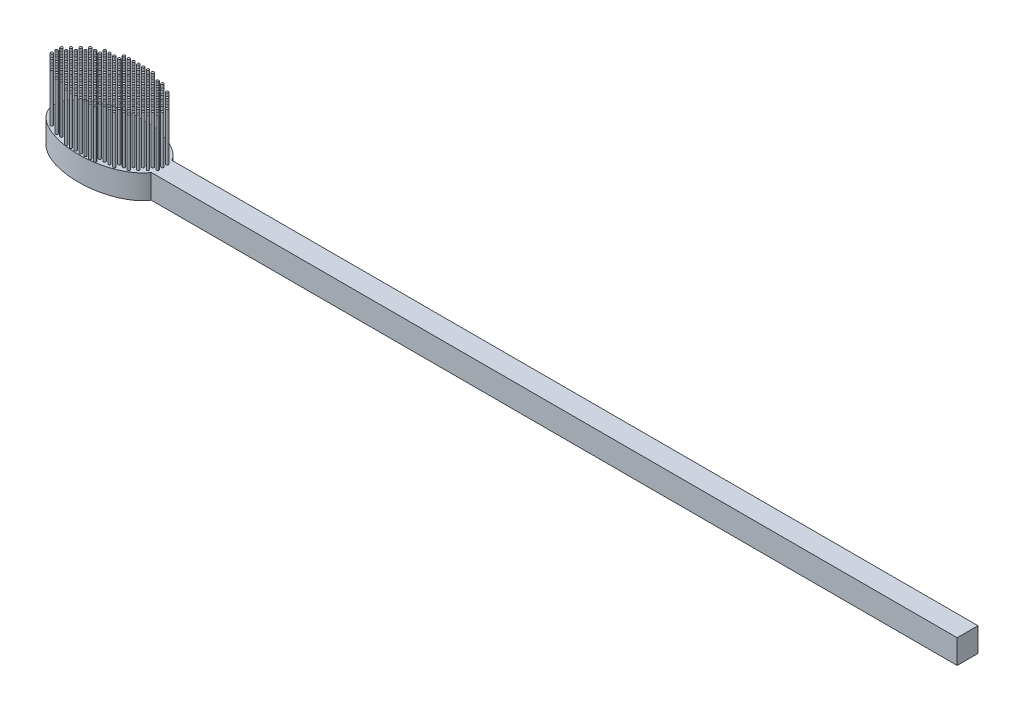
from build123d import *

# Parameters (mm, degrees)
BOSS_EXTRUDE1_DEPTH       = 5
SKETCH3_R                 = 0.25
BOSS_EXTRUDE2_DEPTH       = 10
LPATTERN1_COUNT           = 12
LPATTERN1_PITCH           = 1
LPATTERN1_COUNT_DIR2      = 7
LPATTERN1_PITCH_DIR2      = 1
MIRROR1_COPY_1_SKETCH_R   = 0.25
MIRROR1_COPY_1_DEPTH      = 10
MIRROR1_COPY_2_SKETCH_R   = 0.25
MIRROR1_COPY_2_DEPTH      = 10
MIRROR1_COPY_3_SKETCH_R   = 0.25
MIRROR1_COPY_3_DEPTH      = 10
MIRROR1_COPY_4_SKETCH_R   = 0.25
MIRROR1_COPY_4_DEPTH      = 10
MIRROR1_COPY_5_SKETCH_R   = 0.25
MIRROR1_COPY_5_DEPTH      = 10
MIRROR1_COPY_6_SKETCH_R   = 0.25
MIRROR1_COPY_6_DEPTH      = 10
MIRROR1_COPY_7_SKETCH_R   = 0.25
MIRROR1_COPY_7_DEPTH      = 10
MIRROR1_COPY_8_SKETCH_R   = 0.25
MIRROR1_COPY_8_DEPTH      = 10
MIRROR1_COPY_9_SKETCH_R   = 0.25
MIRROR1_COPY_9_DEPTH      = 10
MIRROR1_COPY_10_SKETCH_R  = 0.25
MIRROR1_COPY_10_DEPTH     = 10
MIRROR1_COPY_11_SKETCH_R  = 0.25
MIRROR1_COPY_11_DEPTH     = 10
MIRROR1_COPY_12_SKETCH_R  = 0.25
MIRROR1_COPY_12_DEPTH     = 10
MIRROR1_COPY_13_SKETCH_R  = 0.25
MIRROR1_COPY_13_DEPTH     = 10
MIRROR1_COPY_14_SKETCH_R  = 0.25
MIRROR1_COPY_14_DEPTH     = 10
MIRROR1_COPY_15_SKETCH_R  = 0.25
MIRROR1_COPY_15_DEPTH     = 10
MIRROR1_COPY_16_SKETCH_R  = 0.25
MIRROR1_COPY_16_DEPTH     = 10
MIRROR1_COPY_17_SKETCH_R  = 0.25
MIRROR1_COPY_17_DEPTH     = 10
MIRROR1_COPY_18_SKETCH_R  = 0.25
MIRROR1_COPY_18_DEPTH     = 10
MIRROR1_COPY_19_SKETCH_R  = 0.25
MIRROR1_COPY_19_DEPTH     = 10
MIRROR1_COPY_20_SKETCH_R  = 0.25
MIRROR1_COPY_20_DEPTH     = 10
MIRROR1_COPY_21_SKETCH_R  = 0.25
MIRROR1_COPY_21_DEPTH     = 10
MIRROR1_COPY_22_SKETCH_R  = 0.25
MIRROR1_COPY_22_DEPTH     = 10
MIRROR1_COPY_23_SKETCH_R  = 0.25
MIRROR1_COPY_23_DEPTH     = 10
MIRROR1_COPY_24_SKETCH_R  = 0.25
MIRROR1_COPY_24_DEPTH     = 10
MIRROR1_COPY_25_SKETCH_R  = 0.25
MIRROR1_COPY_25_DEPTH     = 10
MIRROR1_COPY_26_SKETCH_R  = 0.25
MIRROR1_COPY_26_DEPTH     = 10
MIRROR1_COPY_27_SKETCH_R  = 0.25
MIRROR1_COPY_27_DEPTH     = 10
MIRROR1_COPY_28_SKETCH_R  = 0.25
MIRROR1_COPY_28_DEPTH     = 10
MIRROR1_COPY_29_SKETCH_R  = 0.25
MIRROR1_COPY_29_DEPTH     = 10
MIRROR1_COPY_30_SKETCH_R  = 0.25
MIRROR1_COPY_30_DEPTH     = 10
MIRROR1_COPY_31_SKETCH_R  = 0.25
MIRROR1_COPY_31_DEPTH     = 10
MIRROR1_COPY_32_SKETCH_R  = 0.25
MIRROR1_COPY_32_DEPTH     = 10
MIRROR1_COPY_33_SKETCH_R  = 0.25
MIRROR1_COPY_33_DEPTH     = 10
MIRROR1_COPY_34_SKETCH_R  = 0.25
MIRROR1_COPY_34_DEPTH     = 10
MIRROR1_COPY_35_SKETCH_R  = 0.25
MIRROR1_COPY_35_DEPTH     = 10
MIRROR1_COPY_36_SKETCH_R  = 0.25
MIRROR1_COPY_36_DEPTH     = 10
MIRROR1_COPY_37_SKETCH_R  = 0.25
MIRROR1_COPY_37_DEPTH     = 10
MIRROR1_COPY_38_SKETCH_R  = 0.25
MIRROR1_COPY_38_DEPTH     = 10
MIRROR1_COPY_39_SKETCH_R  = 0.25
MIRROR1_COPY_39_DEPTH     = 10
MIRROR1_COPY_40_SKETCH_R  = 0.25
MIRROR1_COPY_40_DEPTH     = 10
MIRROR1_COPY_41_SKETCH_R  = 0.25
MIRROR1_COPY_41_DEPTH     = 10
MIRROR1_COPY_42_SKETCH_R  = 0.25
MIRROR1_COPY_42_DEPTH     = 10
MIRROR1_COPY_43_SKETCH_R  = 0.25
MIRROR1_COPY_43_DEPTH     = 10
MIRROR1_COPY_44_SKETCH_R  = 0.25
MIRROR1_COPY_44_DEPTH     = 10
MIRROR1_COPY_45_SKETCH_R  = 0.25
MIRROR1_COPY_45_DEPTH     = 10
MIRROR1_COPY_46_SKETCH_R  = 0.25
MIRROR1_COPY_46_DEPTH     = 10
MIRROR1_COPY_47_SKETCH_R  = 0.25
MIRROR1_COPY_47_DEPTH     = 10
MIRROR1_COPY_48_SKETCH_R  = 0.25
MIRROR1_COPY_48_DEPTH     = 10
MIRROR1_COPY_49_SKETCH_R  = 0.25
MIRROR1_COPY_49_DEPTH     = 10
MIRROR1_COPY_50_SKETCH_R  = 0.25
MIRROR1_COPY_50_DEPTH     = 10
MIRROR1_COPY_51_SKETCH_R  = 0.25
MIRROR1_COPY_51_DEPTH     = 10
MIRROR1_COPY_52_SKETCH_R  = 0.25
MIRROR1_COPY_52_DEPTH     = 10
MIRROR1_COPY_53_SKETCH_R  = 0.25
MIRROR1_COPY_53_DEPTH     = 10
MIRROR1_COPY_54_SKETCH_R  = 0.25
MIRROR1_COPY_54_DEPTH     = 10
MIRROR1_COPY_55_SKETCH_R  = 0.25
MIRROR1_COPY_55_DEPTH     = 10
MIRROR1_COPY_56_SKETCH_R  = 0.25
MIRROR1_COPY_56_DEPTH     = 10
MIRROR1_COPY_57_SKETCH_R  = 0.25
MIRROR1_COPY_57_DEPTH     = 10
MIRROR1_COPY_58_SKETCH_R  = 0.25
MIRROR1_COPY_58_DEPTH     = 10
MIRROR1_COPY_59_SKETCH_R  = 0.25
MIRROR1_COPY_59_DEPTH     = 10
MIRROR1_COPY_60_SKETCH_R  = 0.25
MIRROR1_COPY_60_DEPTH     = 10
MIRROR1_COPY_61_SKETCH_R  = 0.25
MIRROR1_COPY_61_DEPTH     = 10
MIRROR1_COPY_62_SKETCH_R  = 0.25
MIRROR1_COPY_62_DEPTH     = 10
MIRROR1_COPY_63_SKETCH_R  = 0.25
MIRROR1_COPY_63_DEPTH     = 10
MIRROR1_COPY_64_SKETCH_R  = 0.25
MIRROR1_COPY_64_DEPTH     = 10
MIRROR1_COPY_65_SKETCH_R  = 0.25
MIRROR1_COPY_65_DEPTH     = 10
MIRROR2_COPY_1_SKETCH_R   = 0.25
MIRROR2_COPY_1_DEPTH      = 10
MIRROR2_COPY_2_SKETCH_R   = 0.25
MIRROR2_COPY_2_DEPTH      = 10
MIRROR2_COPY_3_SKETCH_R   = 0.25
MIRROR2_COPY_3_DEPTH      = 10
MIRROR2_COPY_4_SKETCH_R   = 0.25
MIRROR2_COPY_4_DEPTH      = 10
MIRROR2_COPY_5_SKETCH_R   = 0.25
MIRROR2_COPY_5_DEPTH      = 10
MIRROR2_COPY_6_SKETCH_R   = 0.25
MIRROR2_COPY_6_DEPTH      = 10
MIRROR2_COPY_7_SKETCH_R   = 0.25
MIRROR2_COPY_7_DEPTH      = 10
MIRROR2_COPY_8_SKETCH_R   = 0.25
MIRROR2_COPY_8_DEPTH      = 10
MIRROR2_COPY_9_SKETCH_R   = 0.25
MIRROR2_COPY_9_DEPTH      = 10
MIRROR2_COPY_10_SKETCH_R  = 0.25
MIRROR2_COPY_10_DEPTH     = 10
MIRROR2_COPY_11_SKETCH_R  = 0.25
MIRROR2_COPY_11_DEPTH     = 10
MIRROR2_COPY_12_SKETCH_R  = 0.25
MIRROR2_COPY_12_DEPTH     = 10
MIRROR2_COPY_13_SKETCH_R  = 0.25
MIRROR2_COPY_13_DEPTH     = 10
MIRROR2_COPY_14_SKETCH_R  = 0.25
MIRROR2_COPY_14_DEPTH     = 10
MIRROR2_COPY_15_SKETCH_R  = 0.25
MIRROR2_COPY_15_DEPTH     = 10
MIRROR2_COPY_16_SKETCH_R  = 0.25
MIRROR2_COPY_16_DEPTH     = 10
MIRROR2_COPY_17_SKETCH_R  = 0.25
MIRROR2_COPY_17_DEPTH     = 10
MIRROR2_COPY_18_SKETCH_R  = 0.25
MIRROR2_COPY_18_DEPTH     = 10
MIRROR2_COPY_19_SKETCH_R  = 0.25
MIRROR2_COPY_19_DEPTH     = 10
MIRROR2_COPY_20_SKETCH_R  = 0.25
MIRROR2_COPY_20_DEPTH     = 10
MIRROR2_COPY_21_SKETCH_R  = 0.25
MIRROR2_COPY_21_DEPTH     = 10
MIRROR2_COPY_22_SKETCH_R  = 0.25
MIRROR2_COPY_22_DEPTH     = 10
MIRROR2_COPY_23_SKETCH_R  = 0.25
MIRROR2_COPY_23_DEPTH     = 10
MIRROR2_COPY_24_SKETCH_R  = 0.25
MIRROR2_COPY_24_DEPTH     = 10
MIRROR2_COPY_25_SKETCH_R  = 0.25
MIRROR2_COPY_25_DEPTH     = 10
MIRROR2_COPY_26_SKETCH_R  = 0.25
MIRROR2_COPY_26_DEPTH     = 10
MIRROR2_COPY_27_SKETCH_R  = 0.25
MIRROR2_COPY_27_DEPTH     = 10
MIRROR2_COPY_28_SKETCH_R  = 0.25
MIRROR2_COPY_28_DEPTH     = 10
MIRROR2_COPY_29_SKETCH_R  = 0.25
MIRROR2_COPY_29_DEPTH     = 10
MIRROR2_COPY_30_SKETCH_R  = 0.25
MIRROR2_COPY_30_DEPTH     = 10
MIRROR2_COPY_31_SKETCH_R  = 0.25
MIRROR2_COPY_31_DEPTH     = 10
MIRROR2_COPY_32_SKETCH_R  = 0.25
MIRROR2_COPY_32_DEPTH     = 10
MIRROR2_COPY_33_SKETCH_R  = 0.25
MIRROR2_COPY_33_DEPTH     = 10
MIRROR2_COPY_34_SKETCH_R  = 0.25
MIRROR2_COPY_34_DEPTH     = 10
MIRROR2_COPY_35_SKETCH_R  = 0.25
MIRROR2_COPY_35_DEPTH     = 10
MIRROR2_COPY_36_SKETCH_R  = 0.25
MIRROR2_COPY_36_DEPTH     = 10
MIRROR2_COPY_37_SKETCH_R  = 0.25
MIRROR2_COPY_37_DEPTH     = 10
MIRROR2_COPY_38_SKETCH_R  = 0.25
MIRROR2_COPY_38_DEPTH     = 10
MIRROR2_COPY_39_SKETCH_R  = 0.25
MIRROR2_COPY_39_DEPTH     = 10
MIRROR2_COPY_40_SKETCH_R  = 0.25
MIRROR2_COPY_40_DEPTH     = 10
MIRROR2_COPY_41_SKETCH_R  = 0.25
MIRROR2_COPY_41_DEPTH     = 10
MIRROR2_COPY_42_SKETCH_R  = 0.25
MIRROR2_COPY_42_DEPTH     = 10
MIRROR2_COPY_43_SKETCH_R  = 0.25
MIRROR2_COPY_43_DEPTH     = 10
MIRROR2_COPY_44_SKETCH_R  = 0.25
MIRROR2_COPY_44_DEPTH     = 10
MIRROR2_COPY_45_SKETCH_R  = 0.25
MIRROR2_COPY_45_DEPTH     = 10
MIRROR2_COPY_46_SKETCH_R  = 0.25
MIRROR2_COPY_46_DEPTH     = 10
MIRROR2_COPY_47_SKETCH_R  = 0.25
MIRROR2_COPY_47_DEPTH     = 10
MIRROR2_COPY_48_SKETCH_R  = 0.25
MIRROR2_COPY_48_DEPTH     = 10
MIRROR2_COPY_49_SKETCH_R  = 0.25
MIRROR2_COPY_49_DEPTH     = 10
MIRROR2_COPY_50_SKETCH_R  = 0.25
MIRROR2_COPY_50_DEPTH     = 10
MIRROR2_COPY_51_SKETCH_R  = 0.25
MIRROR2_COPY_51_DEPTH     = 10
MIRROR2_COPY_52_SKETCH_R  = 0.25
MIRROR2_COPY_52_DEPTH     = 10
MIRROR2_COPY_53_SKETCH_R  = 0.25
MIRROR2_COPY_53_DEPTH     = 10
MIRROR2_COPY_54_SKETCH_R  = 0.25
MIRROR2_COPY_54_DEPTH     = 10
MIRROR2_COPY_55_SKETCH_R  = 0.25
MIRROR2_COPY_55_DEPTH     = 10
MIRROR2_COPY_56_SKETCH_R  = 0.25
MIRROR2_COPY_56_DEPTH     = 10
MIRROR2_COPY_57_SKETCH_R  = 0.25
MIRROR2_COPY_57_DEPTH     = 10
MIRROR2_COPY_58_SKETCH_R  = 0.25
MIRROR2_COPY_58_DEPTH     = 10
MIRROR2_COPY_59_SKETCH_R  = 0.25
MIRROR2_COPY_59_DEPTH     = 10
MIRROR2_COPY_60_SKETCH_R  = 0.25
MIRROR2_COPY_60_DEPTH     = 10
MIRROR2_COPY_61_SKETCH_R  = 0.25
MIRROR2_COPY_61_DEPTH     = 10
MIRROR2_COPY_62_SKETCH_R  = 0.25
MIRROR2_COPY_62_DEPTH     = 10
MIRROR2_COPY_63_SKETCH_R  = 0.25
MIRROR2_COPY_63_DEPTH     = 10
MIRROR2_COPY_64_SKETCH_R  = 0.25
MIRROR2_COPY_64_DEPTH     = 10
MIRROR2_COPY_65_SKETCH_R  = 0.25
MIRROR2_COPY_65_DEPTH     = 10
MIRROR2_COPY_66_SKETCH_R  = 0.25
MIRROR2_COPY_66_DEPTH     = 10
MIRROR2_COPY_67_SKETCH_R  = 0.25
MIRROR2_COPY_67_DEPTH     = 10
MIRROR2_COPY_68_SKETCH_R  = 0.25
MIRROR2_COPY_68_DEPTH     = 10
MIRROR2_COPY_69_SKETCH_R  = 0.25
MIRROR2_COPY_69_DEPTH     = 10
MIRROR2_COPY_70_SKETCH_R  = 0.25
MIRROR2_COPY_70_DEPTH     = 10
MIRROR2_COPY_71_SKETCH_R  = 0.25
MIRROR2_COPY_71_DEPTH     = 10
MIRROR2_COPY_72_SKETCH_R  = 0.25
MIRROR2_COPY_72_DEPTH     = 10
MIRROR2_COPY_73_SKETCH_R  = 0.25
MIRROR2_COPY_73_DEPTH     = 10
MIRROR2_COPY_74_SKETCH_R  = 0.25
MIRROR2_COPY_74_DEPTH     = 10
MIRROR2_COPY_75_SKETCH_R  = 0.25
MIRROR2_COPY_75_DEPTH     = 10
MIRROR2_COPY_76_SKETCH_R  = 0.25
MIRROR2_COPY_76_DEPTH     = 10
MIRROR2_COPY_77_SKETCH_R  = 0.25
MIRROR2_COPY_77_DEPTH     = 10
MIRROR2_COPY_78_SKETCH_R  = 0.25
MIRROR2_COPY_78_DEPTH     = 10
MIRROR2_COPY_79_SKETCH_R  = 0.25
MIRROR2_COPY_79_DEPTH     = 10
MIRROR2_COPY_80_SKETCH_R  = 0.25
MIRROR2_COPY_80_DEPTH     = 10
MIRROR2_COPY_81_SKETCH_R  = 0.25
MIRROR2_COPY_81_DEPTH     = 10
MIRROR2_COPY_82_SKETCH_R  = 0.25
MIRROR2_COPY_82_DEPTH     = 10
MIRROR2_COPY_83_SKETCH_R  = 0.25
MIRROR2_COPY_83_DEPTH     = 10
MIRROR2_COPY_84_SKETCH_R  = 0.25
MIRROR2_COPY_84_DEPTH     = 10
MIRROR2_COPY_85_SKETCH_R  = 0.25
MIRROR2_COPY_85_DEPTH     = 10
MIRROR2_COPY_86_SKETCH_R  = 0.25
MIRROR2_COPY_86_DEPTH     = 10
MIRROR2_COPY_87_SKETCH_R  = 0.25
MIRROR2_COPY_87_DEPTH     = 10
MIRROR2_COPY_88_SKETCH_R  = 0.25
MIRROR2_COPY_88_DEPTH     = 10
MIRROR2_COPY_89_SKETCH_R  = 0.25
MIRROR2_COPY_89_DEPTH     = 10
MIRROR2_COPY_90_SKETCH_R  = 0.25
MIRROR2_COPY_90_DEPTH     = 10
MIRROR2_COPY_91_SKETCH_R  = 0.25
MIRROR2_COPY_91_DEPTH     = 10
MIRROR2_COPY_92_SKETCH_R  = 0.25
MIRROR2_COPY_92_DEPTH     = 10
MIRROR2_COPY_93_SKETCH_R  = 0.25
MIRROR2_COPY_93_DEPTH     = 10
MIRROR2_COPY_94_SKETCH_R  = 0.25
MIRROR2_COPY_94_DEPTH     = 10
MIRROR2_COPY_95_SKETCH_R  = 0.25
MIRROR2_COPY_95_DEPTH     = 10
MIRROR2_COPY_96_SKETCH_R  = 0.25
MIRROR2_COPY_96_DEPTH     = 10
MIRROR2_COPY_97_SKETCH_R  = 0.25
MIRROR2_COPY_97_DEPTH     = 10
MIRROR2_COPY_98_SKETCH_R  = 0.25
MIRROR2_COPY_98_DEPTH     = 10
MIRROR2_COPY_99_SKETCH_R  = 0.25
MIRROR2_COPY_99_DEPTH     = 10
MIRROR2_COPY_100_SKETCH_R = 0.25
MIRROR2_COPY_100_DEPTH    = 10
MIRROR2_COPY_101_SKETCH_R = 0.25
MIRROR2_COPY_101_DEPTH    = 10
MIRROR2_COPY_102_SKETCH_R = 0.25
MIRROR2_COPY_102_DEPTH    = 10
MIRROR2_COPY_103_SKETCH_R = 0.25
MIRROR2_COPY_103_DEPTH    = 10
MIRROR2_COPY_104_SKETCH_R = 0.25
MIRROR2_COPY_104_DEPTH    = 10
MIRROR2_COPY_105_SKETCH_R = 0.25
MIRROR2_COPY_105_DEPTH    = 10
MIRROR2_COPY_106_SKETCH_R = 0.25
MIRROR2_COPY_106_DEPTH    = 10
MIRROR2_COPY_107_SKETCH_R = 0.25
MIRROR2_COPY_107_DEPTH    = 10
MIRROR2_COPY_108_SKETCH_R = 0.25
MIRROR2_COPY_108_DEPTH    = 10
MIRROR2_COPY_109_SKETCH_R = 0.25
MIRROR2_COPY_109_DEPTH    = 10
MIRROR2_COPY_110_SKETCH_R = 0.25
MIRROR2_COPY_110_DEPTH    = 10
MIRROR2_COPY_111_SKETCH_R = 0.25
MIRROR2_COPY_111_DEPTH    = 10
MIRROR2_COPY_112_SKETCH_R = 0.25
MIRROR2_COPY_112_DEPTH    = 10
MIRROR2_COPY_113_SKETCH_R = 0.25
MIRROR2_COPY_113_DEPTH    = 10
MIRROR2_COPY_114_SKETCH_R = 0.25
MIRROR2_COPY_114_DEPTH    = 10
MIRROR2_COPY_115_SKETCH_R = 0.25
MIRROR2_COPY_115_DEPTH    = 10
MIRROR2_COPY_116_SKETCH_R = 0.25
MIRROR2_COPY_116_DEPTH    = 10
MIRROR2_COPY_117_SKETCH_R = 0.25
MIRROR2_COPY_117_DEPTH    = 10
MIRROR2_COPY_118_SKETCH_R = 0.25
MIRROR2_COPY_118_DEPTH    = 10
MIRROR2_COPY_119_SKETCH_R = 0.25
MIRROR2_COPY_119_DEPTH    = 10
MIRROR2_COPY_120_SKETCH_R = 0.25
MIRROR2_COPY_120_DEPTH    = 10
MIRROR2_COPY_121_SKETCH_R = 0.25
MIRROR2_COPY_121_DEPTH    = 10
MIRROR2_COPY_122_SKETCH_R = 0.25
MIRROR2_COPY_122_DEPTH    = 10
MIRROR2_COPY_123_SKETCH_R = 0.25
MIRROR2_COPY_123_DEPTH    = 10
MIRROR2_COPY_124_SKETCH_R = 0.25
MIRROR2_COPY_124_DEPTH    = 10
MIRROR2_COPY_125_SKETCH_R = 0.25
MIRROR2_COPY_125_DEPTH    = 10
MIRROR2_COPY_126_SKETCH_R = 0.25
MIRROR2_COPY_126_DEPTH    = 10
MIRROR2_COPY_127_SKETCH_R = 0.25
MIRROR2_COPY_127_DEPTH    = 10
MIRROR2_COPY_128_SKETCH_R = 0.25
MIRROR2_COPY_128_DEPTH    = 10
MIRROR2_COPY_129_SKETCH_R = 0.25
MIRROR2_COPY_129_DEPTH    = 10
MIRROR2_COPY_130_SKETCH_R = 0.25
MIRROR2_COPY_130_DEPTH    = 10
MIRROR2_COPY_131_SKETCH_R = 0.25
MIRROR2_COPY_131_DEPTH    = 10


with BuildPart() as part:
    # Sketch1 → Boss-Extrude1 (new body)
    with BuildSketch(Plane(origin=(0, 0, 0), x_dir=(1, 0, 0), z_dir=(0, 1, 0))):
        with BuildLine():
            Line((10.842303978, -2.166666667), (178.5, -2.166666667))
            Line((178.5, -2.166666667), (178.5, 2.166666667))
            Line((178.5, 2.166666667), (10.842303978, 2.166666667))
            add(Edge.make_bspline(
                [(10.842303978, 2.166666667), (5.660036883, 10.451433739), (-6.838914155, 5.225716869), (-19.337865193, 0), (-6.838914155, -5.225716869), (5.660036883, -10.451433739), (10.842303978, -2.166666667)],
                knots=[0.339836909, 0.339836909, 0.339836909, 2.207674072, 2.207674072, 4.075511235, 4.075511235, 5.943348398, 5.943348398, 5.943348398], degree=2, weights=[1, 0.594688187, 1, 0.594688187, 1, 0.594688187, 1]))
        make_face()
    extrude(amount=-BOSS_EXTRUDE1_DEPTH)

    # Sketch3 → Boss-Extrude2 (add)
    with BuildSketch(Plane(origin=(0, 0, 0), x_dir=(1, 0, 0), z_dir=(0, 1, 0))):
        with Locations(Location((0, 0, 0), (0, 0, 270))):
            Circle(SKETCH3_R)
    boss_extrude2 = extrude(amount=BOSS_EXTRUDE2_DEPTH)

    # LPattern1: Boss-Extrude2 12 × 7, 19 skipped
    with Locations(*[(i * LPATTERN1_PITCH, 0, j * LPATTERN1_PITCH_DIR2) for i in range(LPATTERN1_COUNT) for j in range(LPATTERN1_COUNT_DIR2) if (i, j) not in ((0, 0), (4, 6), (5, 6), (6, 6), (7, 5), (7, 6), (8, 5), (8, 6), (9, 4), (9, 5), (9, 6), (10, 3), (10, 4), (10, 5), (10, 6), (11, 2), (11, 3), (11, 4), (11, 5), (11, 6))]):
        add(boss_extrude2)

    # Mirror1 copy 1 sketch → Mirror1 copy 1 (add)
    with BuildSketch(Plane(origin=(0, 0, -1), x_dir=(1, 0, 0), z_dir=(0, 1, 0))):
        Circle(MIRROR1_COPY_1_SKETCH_R)
    extrude(amount=MIRROR1_COPY_1_DEPTH)

    # Mirror1 copy 2 sketch → Mirror1 copy 2 (add)
    with BuildSketch(Plane(origin=(0, 0, -2), x_dir=(1, 0, 0), z_dir=(0, 1, 0))):
        Circle(MIRROR1_COPY_2_SKETCH_R)
    extrude(amount=MIRROR1_COPY_2_DEPTH)

    # Mirror1 copy 3 sketch → Mirror1 copy 3 (add)
    with BuildSketch(Plane(origin=(0, 0, -3), x_dir=(1, 0, 0), z_dir=(0, 1, 0))):
        Circle(MIRROR1_COPY_3_SKETCH_R)
    extrude(amount=MIRROR1_COPY_3_DEPTH)

    # Mirror1 copy 4 sketch → Mirror1 copy 4 (add)
    with BuildSketch(Plane(origin=(0, 0, -4), x_dir=(1, 0, 0), z_dir=(0, 1, 0))):
        Circle(MIRROR1_COPY_4_SKETCH_R)
    extrude(amount=MIRROR1_COPY_4_DEPTH)

    # Mirror1 copy 5 sketch → Mirror1 copy 5 (add)
    with BuildSketch(Plane(origin=(0, 0, -5), x_dir=(1, 0, 0), z_dir=(0, 1, 0))):
        Circle(MIRROR1_COPY_5_SKETCH_R)
    extrude(amount=MIRROR1_COPY_5_DEPTH)

    # Mirror1 copy 6 sketch → Mirror1 copy 6 (add)
    with BuildSketch(Plane(origin=(0, 0, -6), x_dir=(1, 0, 0), z_dir=(0, 1, 0))):
        Circle(MIRROR1_COPY_6_SKETCH_R)
    extrude(amount=MIRROR1_COPY_6_DEPTH)

    # Mirror1 copy 7 sketch → Mirror1 copy 7 (add)
    with BuildSketch(Plane(origin=(1, 0, 0), x_dir=(1, 0, 0), z_dir=(0, 1, 0))):
        Circle(MIRROR1_COPY_7_SKETCH_R)
    extrude(amount=MIRROR1_COPY_7_DEPTH)

    # Mirror1 copy 8 sketch → Mirror1 copy 8 (add)
    with BuildSketch(Plane(origin=(1, 0, -1), x_dir=(1, 0, 0), z_dir=(0, 1, 0))):
        Circle(MIRROR1_COPY_8_SKETCH_R)
    extrude(amount=MIRROR1_COPY_8_DEPTH)

    # Mirror1 copy 9 sketch → Mirror1 copy 9 (add)
    with BuildSketch(Plane(origin=(1, 0, -2), x_dir=(1, 0, 0), z_dir=(0, 1, 0))):
        Circle(MIRROR1_COPY_9_SKETCH_R)
    extrude(amount=MIRROR1_COPY_9_DEPTH)

    # Mirror1 copy 10 sketch → Mirror1 copy 10 (add)
    with BuildSketch(Plane(origin=(1, 0, -3), x_dir=(1, 0, 0), z_dir=(0, 1, 0))):
        Circle(MIRROR1_COPY_10_SKETCH_R)
    extrude(amount=MIRROR1_COPY_10_DEPTH)

    # Mirror1 copy 11 sketch → Mirror1 copy 11 (add)
    with BuildSketch(Plane(origin=(1, 0, -4), x_dir=(1, 0, 0), z_dir=(0, 1, 0))):
        Circle(MIRROR1_COPY_11_SKETCH_R)
    extrude(amount=MIRROR1_COPY_11_DEPTH)

    # Mirror1 copy 12 sketch → Mirror1 copy 12 (add)
    with BuildSketch(Plane(origin=(1, 0, -5), x_dir=(1, 0, 0), z_dir=(0, 1, 0))):
        Circle(MIRROR1_COPY_12_SKETCH_R)
    extrude(amount=MIRROR1_COPY_12_DEPTH)

    # Mirror1 copy 13 sketch → Mirror1 copy 13 (add)
    with BuildSketch(Plane(origin=(1, 0, -6), x_dir=(1, 0, 0), z_dir=(0, 1, 0))):
        Circle(MIRROR1_COPY_13_SKETCH_R)
    extrude(amount=MIRROR1_COPY_13_DEPTH)

    # Mirror1 copy 14 sketch → Mirror1 copy 14 (add)
    with BuildSketch(Plane(origin=(2, 0, 0), x_dir=(1, 0, 0), z_dir=(0, 1, 0))):
        Circle(MIRROR1_COPY_14_SKETCH_R)
    extrude(amount=MIRROR1_COPY_14_DEPTH)

    # Mirror1 copy 15 sketch → Mirror1 copy 15 (add)
    with BuildSketch(Plane(origin=(2, 0, -1), x_dir=(1, 0, 0), z_dir=(0, 1, 0))):
        Circle(MIRROR1_COPY_15_SKETCH_R)
    extrude(amount=MIRROR1_COPY_15_DEPTH)

    # Mirror1 copy 16 sketch → Mirror1 copy 16 (add)
    with BuildSketch(Plane(origin=(2, 0, -2), x_dir=(1, 0, 0), z_dir=(0, 1, 0))):
        Circle(MIRROR1_COPY_16_SKETCH_R)
    extrude(amount=MIRROR1_COPY_16_DEPTH)

    # Mirror1 copy 17 sketch → Mirror1 copy 17 (add)
    with BuildSketch(Plane(origin=(2, 0, -3), x_dir=(1, 0, 0), z_dir=(0, 1, 0))):
        Circle(MIRROR1_COPY_17_SKETCH_R)
    extrude(amount=MIRROR1_COPY_17_DEPTH)

    # Mirror1 copy 18 sketch → Mirror1 copy 18 (add)
    with BuildSketch(Plane(origin=(2, 0, -4), x_dir=(1, 0, 0), z_dir=(0, 1, 0))):
        Circle(MIRROR1_COPY_18_SKETCH_R)
    extrude(amount=MIRROR1_COPY_18_DEPTH)

    # Mirror1 copy 19 sketch → Mirror1 copy 19 (add)
    with BuildSketch(Plane(origin=(2, 0, -5), x_dir=(1, 0, 0), z_dir=(0, 1, 0))):
        Circle(MIRROR1_COPY_19_SKETCH_R)
    extrude(amount=MIRROR1_COPY_19_DEPTH)

    # Mirror1 copy 20 sketch → Mirror1 copy 20 (add)
    with BuildSketch(Plane(origin=(2, 0, -6), x_dir=(1, 0, 0), z_dir=(0, 1, 0))):
        Circle(MIRROR1_COPY_20_SKETCH_R)
    extrude(amount=MIRROR1_COPY_20_DEPTH)

    # Mirror1 copy 21 sketch → Mirror1 copy 21 (add)
    with BuildSketch(Plane(origin=(3, 0, 0), x_dir=(1, 0, 0), z_dir=(0, 1, 0))):
        Circle(MIRROR1_COPY_21_SKETCH_R)
    extrude(amount=MIRROR1_COPY_21_DEPTH)

    # Mirror1 copy 22 sketch → Mirror1 copy 22 (add)
    with BuildSketch(Plane(origin=(3, 0, -1), x_dir=(1, 0, 0), z_dir=(0, 1, 0))):
        Circle(MIRROR1_COPY_22_SKETCH_R)
    extrude(amount=MIRROR1_COPY_22_DEPTH)

    # Mirror1 copy 23 sketch → Mirror1 copy 23 (add)
    with BuildSketch(Plane(origin=(3, 0, -2), x_dir=(1, 0, 0), z_dir=(0, 1, 0))):
        Circle(MIRROR1_COPY_23_SKETCH_R)
    extrude(amount=MIRROR1_COPY_23_DEPTH)

    # Mirror1 copy 24 sketch → Mirror1 copy 24 (add)
    with BuildSketch(Plane(origin=(3, 0, -3), x_dir=(1, 0, 0), z_dir=(0, 1, 0))):
        Circle(MIRROR1_COPY_24_SKETCH_R)
    extrude(amount=MIRROR1_COPY_24_DEPTH)

    # Mirror1 copy 25 sketch → Mirror1 copy 25 (add)
    with BuildSketch(Plane(origin=(3, 0, -4), x_dir=(1, 0, 0), z_dir=(0, 1, 0))):
        Circle(MIRROR1_COPY_25_SKETCH_R)
    extrude(amount=MIRROR1_COPY_25_DEPTH)

    # Mirror1 copy 26 sketch → Mirror1 copy 26 (add)
    with BuildSketch(Plane(origin=(3, 0, -5), x_dir=(1, 0, 0), z_dir=(0, 1, 0))):
        Circle(MIRROR1_COPY_26_SKETCH_R)
    extrude(amount=MIRROR1_COPY_26_DEPTH)

    # Mirror1 copy 27 sketch → Mirror1 copy 27 (add)
    with BuildSketch(Plane(origin=(3, 0, -6), x_dir=(1, 0, 0), z_dir=(0, 1, 0))):
        Circle(MIRROR1_COPY_27_SKETCH_R)
    extrude(amount=MIRROR1_COPY_27_DEPTH)

    # Mirror1 copy 28 sketch → Mirror1 copy 28 (add)
    with BuildSketch(Plane(origin=(4, 0, 0), x_dir=(1, 0, 0), z_dir=(0, 1, 0))):
        Circle(MIRROR1_COPY_28_SKETCH_R)
    extrude(amount=MIRROR1_COPY_28_DEPTH)

    # Mirror1 copy 29 sketch → Mirror1 copy 29 (add)
    with BuildSketch(Plane(origin=(4, 0, -1), x_dir=(1, 0, 0), z_dir=(0, 1, 0))):
        Circle(MIRROR1_COPY_29_SKETCH_R)
    extrude(amount=MIRROR1_COPY_29_DEPTH)

    # Mirror1 copy 30 sketch → Mirror1 copy 30 (add)
    with BuildSketch(Plane(origin=(4, 0, -2), x_dir=(1, 0, 0), z_dir=(0, 1, 0))):
        Circle(MIRROR1_COPY_30_SKETCH_R)
    extrude(amount=MIRROR1_COPY_30_DEPTH)

    # Mirror1 copy 31 sketch → Mirror1 copy 31 (add)
    with BuildSketch(Plane(origin=(4, 0, -3), x_dir=(1, 0, 0), z_dir=(0, 1, 0))):
        Circle(MIRROR1_COPY_31_SKETCH_R)
    extrude(amount=MIRROR1_COPY_31_DEPTH)

    # Mirror1 copy 32 sketch → Mirror1 copy 32 (add)
    with BuildSketch(Plane(origin=(4, 0, -4), x_dir=(1, 0, 0), z_dir=(0, 1, 0))):
        Circle(MIRROR1_COPY_32_SKETCH_R)
    extrude(amount=MIRROR1_COPY_32_DEPTH)

    # Mirror1 copy 33 sketch → Mirror1 copy 33 (add)
    with BuildSketch(Plane(origin=(4, 0, -5), x_dir=(1, 0, 0), z_dir=(0, 1, 0))):
        Circle(MIRROR1_COPY_33_SKETCH_R)
    extrude(amount=MIRROR1_COPY_33_DEPTH)

    # Mirror1 copy 34 sketch → Mirror1 copy 34 (add)
    with BuildSketch(Plane(origin=(5, 0, 0), x_dir=(1, 0, 0), z_dir=(0, 1, 0))):
        Circle(MIRROR1_COPY_34_SKETCH_R)
    extrude(amount=MIRROR1_COPY_34_DEPTH)

    # Mirror1 copy 35 sketch → Mirror1 copy 35 (add)
    with BuildSketch(Plane(origin=(5, 0, -1), x_dir=(1, 0, 0), z_dir=(0, 1, 0))):
        Circle(MIRROR1_COPY_35_SKETCH_R)
    extrude(amount=MIRROR1_COPY_35_DEPTH)

    # Mirror1 copy 36 sketch → Mirror1 copy 36 (add)
    with BuildSketch(Plane(origin=(5, 0, -2), x_dir=(1, 0, 0), z_dir=(0, 1, 0))):
        Circle(MIRROR1_COPY_36_SKETCH_R)
    extrude(amount=MIRROR1_COPY_36_DEPTH)

    # Mirror1 copy 37 sketch → Mirror1 copy 37 (add)
    with BuildSketch(Plane(origin=(5, 0, -3), x_dir=(1, 0, 0), z_dir=(0, 1, 0))):
        Circle(MIRROR1_COPY_37_SKETCH_R)
    extrude(amount=MIRROR1_COPY_37_DEPTH)

    # Mirror1 copy 38 sketch → Mirror1 copy 38 (add)
    with BuildSketch(Plane(origin=(5, 0, -4), x_dir=(1, 0, 0), z_dir=(0, 1, 0))):
        Circle(MIRROR1_COPY_38_SKETCH_R)
    extrude(amount=MIRROR1_COPY_38_DEPTH)

    # Mirror1 copy 39 sketch → Mirror1 copy 39 (add)
    with BuildSketch(Plane(origin=(5, 0, -5), x_dir=(1, 0, 0), z_dir=(0, 1, 0))):
        Circle(MIRROR1_COPY_39_SKETCH_R)
    extrude(amount=MIRROR1_COPY_39_DEPTH)

    # Mirror1 copy 40 sketch → Mirror1 copy 40 (add)
    with BuildSketch(Plane(origin=(6, 0, 0), x_dir=(1, 0, 0), z_dir=(0, 1, 0))):
        Circle(MIRROR1_COPY_40_SKETCH_R)
    extrude(amount=MIRROR1_COPY_40_DEPTH)

    # Mirror1 copy 41 sketch → Mirror1 copy 41 (add)
    with BuildSketch(Plane(origin=(6, 0, -1), x_dir=(1, 0, 0), z_dir=(0, 1, 0))):
        Circle(MIRROR1_COPY_41_SKETCH_R)
    extrude(amount=MIRROR1_COPY_41_DEPTH)

    # Mirror1 copy 42 sketch → Mirror1 copy 42 (add)
    with BuildSketch(Plane(origin=(6, 0, -2), x_dir=(1, 0, 0), z_dir=(0, 1, 0))):
        Circle(MIRROR1_COPY_42_SKETCH_R)
    extrude(amount=MIRROR1_COPY_42_DEPTH)

    # Mirror1 copy 43 sketch → Mirror1 copy 43 (add)
    with BuildSketch(Plane(origin=(6, 0, -3), x_dir=(1, 0, 0), z_dir=(0, 1, 0))):
        Circle(MIRROR1_COPY_43_SKETCH_R)
    extrude(amount=MIRROR1_COPY_43_DEPTH)

    # Mirror1 copy 44 sketch → Mirror1 copy 44 (add)
    with BuildSketch(Plane(origin=(6, 0, -4), x_dir=(1, 0, 0), z_dir=(0, 1, 0))):
        Circle(MIRROR1_COPY_44_SKETCH_R)
    extrude(amount=MIRROR1_COPY_44_DEPTH)

    # Mirror1 copy 45 sketch → Mirror1 copy 45 (add)
    with BuildSketch(Plane(origin=(6, 0, -5), x_dir=(1, 0, 0), z_dir=(0, 1, 0))):
        Circle(MIRROR1_COPY_45_SKETCH_R)
    extrude(amount=MIRROR1_COPY_45_DEPTH)

    # Mirror1 copy 46 sketch → Mirror1 copy 46 (add)
    with BuildSketch(Plane(origin=(7, 0, 0), x_dir=(1, 0, 0), z_dir=(0, 1, 0))):
        Circle(MIRROR1_COPY_46_SKETCH_R)
    extrude(amount=MIRROR1_COPY_46_DEPTH)

    # Mirror1 copy 47 sketch → Mirror1 copy 47 (add)
    with BuildSketch(Plane(origin=(7, 0, -1), x_dir=(1, 0, 0), z_dir=(0, 1, 0))):
        Circle(MIRROR1_COPY_47_SKETCH_R)
    extrude(amount=MIRROR1_COPY_47_DEPTH)

    # Mirror1 copy 48 sketch → Mirror1 copy 48 (add)
    with BuildSketch(Plane(origin=(7, 0, -2), x_dir=(1, 0, 0), z_dir=(0, 1, 0))):
        Circle(MIRROR1_COPY_48_SKETCH_R)
    extrude(amount=MIRROR1_COPY_48_DEPTH)

    # Mirror1 copy 49 sketch → Mirror1 copy 49 (add)
    with BuildSketch(Plane(origin=(7, 0, -3), x_dir=(1, 0, 0), z_dir=(0, 1, 0))):
        Circle(MIRROR1_COPY_49_SKETCH_R)
    extrude(amount=MIRROR1_COPY_49_DEPTH)

    # Mirror1 copy 50 sketch → Mirror1 copy 50 (add)
    with BuildSketch(Plane(origin=(7, 0, -4), x_dir=(1, 0, 0), z_dir=(0, 1, 0))):
        Circle(MIRROR1_COPY_50_SKETCH_R)
    extrude(amount=MIRROR1_COPY_50_DEPTH)

    # Mirror1 copy 51 sketch → Mirror1 copy 51 (add)
    with BuildSketch(Plane(origin=(8, 0, 0), x_dir=(1, 0, 0), z_dir=(0, 1, 0))):
        Circle(MIRROR1_COPY_51_SKETCH_R)
    extrude(amount=MIRROR1_COPY_51_DEPTH)

    # Mirror1 copy 52 sketch → Mirror1 copy 52 (add)
    with BuildSketch(Plane(origin=(8, 0, -1), x_dir=(1, 0, 0), z_dir=(0, 1, 0))):
        Circle(MIRROR1_COPY_52_SKETCH_R)
    extrude(amount=MIRROR1_COPY_52_DEPTH)

    # Mirror1 copy 53 sketch → Mirror1 copy 53 (add)
    with BuildSketch(Plane(origin=(8, 0, -2), x_dir=(1, 0, 0), z_dir=(0, 1, 0))):
        Circle(MIRROR1_COPY_53_SKETCH_R)
    extrude(amount=MIRROR1_COPY_53_DEPTH)

    # Mirror1 copy 54 sketch → Mirror1 copy 54 (add)
    with BuildSketch(Plane(origin=(8, 0, -3), x_dir=(1, 0, 0), z_dir=(0, 1, 0))):
        Circle(MIRROR1_COPY_54_SKETCH_R)
    extrude(amount=MIRROR1_COPY_54_DEPTH)

    # Mirror1 copy 55 sketch → Mirror1 copy 55 (add)
    with BuildSketch(Plane(origin=(8, 0, -4), x_dir=(1, 0, 0), z_dir=(0, 1, 0))):
        Circle(MIRROR1_COPY_55_SKETCH_R)
    extrude(amount=MIRROR1_COPY_55_DEPTH)

    # Mirror1 copy 56 sketch → Mirror1 copy 56 (add)
    with BuildSketch(Plane(origin=(9, 0, 0), x_dir=(1, 0, 0), z_dir=(0, 1, 0))):
        Circle(MIRROR1_COPY_56_SKETCH_R)
    extrude(amount=MIRROR1_COPY_56_DEPTH)

    # Mirror1 copy 57 sketch → Mirror1 copy 57 (add)
    with BuildSketch(Plane(origin=(9, 0, -1), x_dir=(1, 0, 0), z_dir=(0, 1, 0))):
        Circle(MIRROR1_COPY_57_SKETCH_R)
    extrude(amount=MIRROR1_COPY_57_DEPTH)

    # Mirror1 copy 58 sketch → Mirror1 copy 58 (add)
    with BuildSketch(Plane(origin=(9, 0, -2), x_dir=(1, 0, 0), z_dir=(0, 1, 0))):
        Circle(MIRROR1_COPY_58_SKETCH_R)
    extrude(amount=MIRROR1_COPY_58_DEPTH)

    # Mirror1 copy 59 sketch → Mirror1 copy 59 (add)
    with BuildSketch(Plane(origin=(9, 0, -3), x_dir=(1, 0, 0), z_dir=(0, 1, 0))):
        Circle(MIRROR1_COPY_59_SKETCH_R)
    extrude(amount=MIRROR1_COPY_59_DEPTH)

    # Mirror1 copy 60 sketch → Mirror1 copy 60 (add)
    with BuildSketch(Plane(origin=(10, 0, 0), x_dir=(1, 0, 0), z_dir=(0, 1, 0))):
        Circle(MIRROR1_COPY_60_SKETCH_R)
    extrude(amount=MIRROR1_COPY_60_DEPTH)

    # Mirror1 copy 61 sketch → Mirror1 copy 61 (add)
    with BuildSketch(Plane(origin=(10, 0, -1), x_dir=(1, 0, 0), z_dir=(0, 1, 0))):
        Circle(MIRROR1_COPY_61_SKETCH_R)
    extrude(amount=MIRROR1_COPY_61_DEPTH)

    # Mirror1 copy 62 sketch → Mirror1 copy 62 (add)
    with BuildSketch(Plane(origin=(10, 0, -2), x_dir=(1, 0, 0), z_dir=(0, 1, 0))):
        Circle(MIRROR1_COPY_62_SKETCH_R)
    extrude(amount=MIRROR1_COPY_62_DEPTH)

    # Mirror1 copy 63 sketch → Mirror1 copy 63 (add)
    with BuildSketch(Plane(origin=(11, 0, 0), x_dir=(1, 0, 0), z_dir=(0, 1, 0))):
        Circle(MIRROR1_COPY_63_SKETCH_R)
    extrude(amount=MIRROR1_COPY_63_DEPTH)

    # Mirror1 copy 64 sketch → Mirror1 copy 64 (add)
    with BuildSketch(Plane(origin=(11, 0, -1), x_dir=(1, 0, 0), z_dir=(0, 1, 0))):
        Circle(MIRROR1_COPY_64_SKETCH_R)
    extrude(amount=MIRROR1_COPY_64_DEPTH)

    # Mirror1 copy 65 sketch → Mirror1 copy 65 (add)
    with BuildSketch(Plane(origin=(0, 0, 0), x_dir=(1, 0, 0), z_dir=(0, 1, 0))):
        Circle(MIRROR1_COPY_65_SKETCH_R)
    extrude(amount=MIRROR1_COPY_65_DEPTH)

    # Mirror2 copy 1 sketch → Mirror2 copy 1 (add)
    with BuildSketch(Plane(origin=(0, 0, 1), x_dir=(-1, 0, 0), z_dir=(0, 1, 0))):
        Circle(MIRROR2_COPY_1_SKETCH_R)
    extrude(amount=MIRROR2_COPY_1_DEPTH)

    # Mirror2 copy 2 sketch → Mirror2 copy 2 (add)
    with BuildSketch(Plane(origin=(0, 0, 2), x_dir=(-1, 0, 0), z_dir=(0, 1, 0))):
        Circle(MIRROR2_COPY_2_SKETCH_R)
    extrude(amount=MIRROR2_COPY_2_DEPTH)

    # Mirror2 copy 3 sketch → Mirror2 copy 3 (add)
    with BuildSketch(Plane(origin=(0, 0, 3), x_dir=(-1, 0, 0), z_dir=(0, 1, 0))):
        Circle(MIRROR2_COPY_3_SKETCH_R)
    extrude(amount=MIRROR2_COPY_3_DEPTH)

    # Mirror2 copy 4 sketch → Mirror2 copy 4 (add)
    with BuildSketch(Plane(origin=(0, 0, 4), x_dir=(-1, 0, 0), z_dir=(0, 1, 0))):
        Circle(MIRROR2_COPY_4_SKETCH_R)
    extrude(amount=MIRROR2_COPY_4_DEPTH)

    # Mirror2 copy 5 sketch → Mirror2 copy 5 (add)
    with BuildSketch(Plane(origin=(0, 0, 5), x_dir=(-1, 0, 0), z_dir=(0, 1, 0))):
        Circle(MIRROR2_COPY_5_SKETCH_R)
    extrude(amount=MIRROR2_COPY_5_DEPTH)

    # Mirror2 copy 6 sketch → Mirror2 copy 6 (add)
    with BuildSketch(Plane(origin=(0, 0, 6), x_dir=(-1, 0, 0), z_dir=(0, 1, 0))):
        Circle(MIRROR2_COPY_6_SKETCH_R)
    extrude(amount=MIRROR2_COPY_6_DEPTH)

    # Mirror2 copy 7 sketch → Mirror2 copy 7 (add)
    with BuildSketch(Plane(origin=(-1, 0, 0), x_dir=(-1, 0, 0), z_dir=(0, 1, 0))):
        Circle(MIRROR2_COPY_7_SKETCH_R)
    extrude(amount=MIRROR2_COPY_7_DEPTH)

    # Mirror2 copy 8 sketch → Mirror2 copy 8 (add)
    with BuildSketch(Plane(origin=(-1, 0, 1), x_dir=(-1, 0, 0), z_dir=(0, 1, 0))):
        Circle(MIRROR2_COPY_8_SKETCH_R)
    extrude(amount=MIRROR2_COPY_8_DEPTH)

    # Mirror2 copy 9 sketch → Mirror2 copy 9 (add)
    with BuildSketch(Plane(origin=(-1, 0, 2), x_dir=(-1, 0, 0), z_dir=(0, 1, 0))):
        Circle(MIRROR2_COPY_9_SKETCH_R)
    extrude(amount=MIRROR2_COPY_9_DEPTH)

    # Mirror2 copy 10 sketch → Mirror2 copy 10 (add)
    with BuildSketch(Plane(origin=(-1, 0, 3), x_dir=(-1, 0, 0), z_dir=(0, 1, 0))):
        Circle(MIRROR2_COPY_10_SKETCH_R)
    extrude(amount=MIRROR2_COPY_10_DEPTH)

    # Mirror2 copy 11 sketch → Mirror2 copy 11 (add)
    with BuildSketch(Plane(origin=(-1, 0, 4), x_dir=(-1, 0, 0), z_dir=(0, 1, 0))):
        Circle(MIRROR2_COPY_11_SKETCH_R)
    extrude(amount=MIRROR2_COPY_11_DEPTH)

    # Mirror2 copy 12 sketch → Mirror2 copy 12 (add)
    with BuildSketch(Plane(origin=(-1, 0, 5), x_dir=(-1, 0, 0), z_dir=(0, 1, 0))):
        Circle(MIRROR2_COPY_12_SKETCH_R)
    extrude(amount=MIRROR2_COPY_12_DEPTH)

    # Mirror2 copy 13 sketch → Mirror2 copy 13 (add)
    with BuildSketch(Plane(origin=(-1, 0, 6), x_dir=(-1, 0, 0), z_dir=(0, 1, 0))):
        Circle(MIRROR2_COPY_13_SKETCH_R)
    extrude(amount=MIRROR2_COPY_13_DEPTH)

    # Mirror2 copy 14 sketch → Mirror2 copy 14 (add)
    with BuildSketch(Plane(origin=(-2, 0, 0), x_dir=(-1, 0, 0), z_dir=(0, 1, 0))):
        Circle(MIRROR2_COPY_14_SKETCH_R)
    extrude(amount=MIRROR2_COPY_14_DEPTH)

    # Mirror2 copy 15 sketch → Mirror2 copy 15 (add)
    with BuildSketch(Plane(origin=(-2, 0, 1), x_dir=(-1, 0, 0), z_dir=(0, 1, 0))):
        Circle(MIRROR2_COPY_15_SKETCH_R)
    extrude(amount=MIRROR2_COPY_15_DEPTH)

    # Mirror2 copy 16 sketch → Mirror2 copy 16 (add)
    with BuildSketch(Plane(origin=(-2, 0, 2), x_dir=(-1, 0, 0), z_dir=(0, 1, 0))):
        Circle(MIRROR2_COPY_16_SKETCH_R)
    extrude(amount=MIRROR2_COPY_16_DEPTH)

    # Mirror2 copy 17 sketch → Mirror2 copy 17 (add)
    with BuildSketch(Plane(origin=(-2, 0, 3), x_dir=(-1, 0, 0), z_dir=(0, 1, 0))):
        Circle(MIRROR2_COPY_17_SKETCH_R)
    extrude(amount=MIRROR2_COPY_17_DEPTH)

    # Mirror2 copy 18 sketch → Mirror2 copy 18 (add)
    with BuildSketch(Plane(origin=(-2, 0, 4), x_dir=(-1, 0, 0), z_dir=(0, 1, 0))):
        Circle(MIRROR2_COPY_18_SKETCH_R)
    extrude(amount=MIRROR2_COPY_18_DEPTH)

    # Mirror2 copy 19 sketch → Mirror2 copy 19 (add)
    with BuildSketch(Plane(origin=(-2, 0, 5), x_dir=(-1, 0, 0), z_dir=(0, 1, 0))):
        Circle(MIRROR2_COPY_19_SKETCH_R)
    extrude(amount=MIRROR2_COPY_19_DEPTH)

    # Mirror2 copy 20 sketch → Mirror2 copy 20 (add)
    with BuildSketch(Plane(origin=(-2, 0, 6), x_dir=(-1, 0, 0), z_dir=(0, 1, 0))):
        Circle(MIRROR2_COPY_20_SKETCH_R)
    extrude(amount=MIRROR2_COPY_20_DEPTH)

    # Mirror2 copy 21 sketch → Mirror2 copy 21 (add)
    with BuildSketch(Plane(origin=(-3, 0, 0), x_dir=(-1, 0, 0), z_dir=(0, 1, 0))):
        Circle(MIRROR2_COPY_21_SKETCH_R)
    extrude(amount=MIRROR2_COPY_21_DEPTH)

    # Mirror2 copy 22 sketch → Mirror2 copy 22 (add)
    with BuildSketch(Plane(origin=(-3, 0, 1), x_dir=(-1, 0, 0), z_dir=(0, 1, 0))):
        Circle(MIRROR2_COPY_22_SKETCH_R)
    extrude(amount=MIRROR2_COPY_22_DEPTH)

    # Mirror2 copy 23 sketch → Mirror2 copy 23 (add)
    with BuildSketch(Plane(origin=(-3, 0, 2), x_dir=(-1, 0, 0), z_dir=(0, 1, 0))):
        Circle(MIRROR2_COPY_23_SKETCH_R)
    extrude(amount=MIRROR2_COPY_23_DEPTH)

    # Mirror2 copy 24 sketch → Mirror2 copy 24 (add)
    with BuildSketch(Plane(origin=(-3, 0, 3), x_dir=(-1, 0, 0), z_dir=(0, 1, 0))):
        Circle(MIRROR2_COPY_24_SKETCH_R)
    extrude(amount=MIRROR2_COPY_24_DEPTH)

    # Mirror2 copy 25 sketch → Mirror2 copy 25 (add)
    with BuildSketch(Plane(origin=(-3, 0, 4), x_dir=(-1, 0, 0), z_dir=(0, 1, 0))):
        Circle(MIRROR2_COPY_25_SKETCH_R)
    extrude(amount=MIRROR2_COPY_25_DEPTH)

    # Mirror2 copy 26 sketch → Mirror2 copy 26 (add)
    with BuildSketch(Plane(origin=(-3, 0, 5), x_dir=(-1, 0, 0), z_dir=(0, 1, 0))):
        Circle(MIRROR2_COPY_26_SKETCH_R)
    extrude(amount=MIRROR2_COPY_26_DEPTH)

    # Mirror2 copy 27 sketch → Mirror2 copy 27 (add)
    with BuildSketch(Plane(origin=(-3, 0, 6), x_dir=(-1, 0, 0), z_dir=(0, 1, 0))):
        Circle(MIRROR2_COPY_27_SKETCH_R)
    extrude(amount=MIRROR2_COPY_27_DEPTH)

    # Mirror2 copy 28 sketch → Mirror2 copy 28 (add)
    with BuildSketch(Plane(origin=(-4, 0, 0), x_dir=(-1, 0, 0), z_dir=(0, 1, 0))):
        Circle(MIRROR2_COPY_28_SKETCH_R)
    extrude(amount=MIRROR2_COPY_28_DEPTH)

    # Mirror2 copy 29 sketch → Mirror2 copy 29 (add)
    with BuildSketch(Plane(origin=(-4, 0, 1), x_dir=(-1, 0, 0), z_dir=(0, 1, 0))):
        Circle(MIRROR2_COPY_29_SKETCH_R)
    extrude(amount=MIRROR2_COPY_29_DEPTH)

    # Mirror2 copy 30 sketch → Mirror2 copy 30 (add)
    with BuildSketch(Plane(origin=(-4, 0, 2), x_dir=(-1, 0, 0), z_dir=(0, 1, 0))):
        Circle(MIRROR2_COPY_30_SKETCH_R)
    extrude(amount=MIRROR2_COPY_30_DEPTH)

    # Mirror2 copy 31 sketch → Mirror2 copy 31 (add)
    with BuildSketch(Plane(origin=(-4, 0, 3), x_dir=(-1, 0, 0), z_dir=(0, 1, 0))):
        Circle(MIRROR2_COPY_31_SKETCH_R)
    extrude(amount=MIRROR2_COPY_31_DEPTH)

    # Mirror2 copy 32 sketch → Mirror2 copy 32 (add)
    with BuildSketch(Plane(origin=(-4, 0, 4), x_dir=(-1, 0, 0), z_dir=(0, 1, 0))):
        Circle(MIRROR2_COPY_32_SKETCH_R)
    extrude(amount=MIRROR2_COPY_32_DEPTH)

    # Mirror2 copy 33 sketch → Mirror2 copy 33 (add)
    with BuildSketch(Plane(origin=(-4, 0, 5), x_dir=(-1, 0, 0), z_dir=(0, 1, 0))):
        Circle(MIRROR2_COPY_33_SKETCH_R)
    extrude(amount=MIRROR2_COPY_33_DEPTH)

    # Mirror2 copy 34 sketch → Mirror2 copy 34 (add)
    with BuildSketch(Plane(origin=(-5, 0, 0), x_dir=(-1, 0, 0), z_dir=(0, 1, 0))):
        Circle(MIRROR2_COPY_34_SKETCH_R)
    extrude(amount=MIRROR2_COPY_34_DEPTH)

    # Mirror2 copy 35 sketch → Mirror2 copy 35 (add)
    with BuildSketch(Plane(origin=(-5, 0, 1), x_dir=(-1, 0, 0), z_dir=(0, 1, 0))):
        Circle(MIRROR2_COPY_35_SKETCH_R)
    extrude(amount=MIRROR2_COPY_35_DEPTH)

    # Mirror2 copy 36 sketch → Mirror2 copy 36 (add)
    with BuildSketch(Plane(origin=(-5, 0, 2), x_dir=(-1, 0, 0), z_dir=(0, 1, 0))):
        Circle(MIRROR2_COPY_36_SKETCH_R)
    extrude(amount=MIRROR2_COPY_36_DEPTH)

    # Mirror2 copy 37 sketch → Mirror2 copy 37 (add)
    with BuildSketch(Plane(origin=(-5, 0, 3), x_dir=(-1, 0, 0), z_dir=(0, 1, 0))):
        Circle(MIRROR2_COPY_37_SKETCH_R)
    extrude(amount=MIRROR2_COPY_37_DEPTH)

    # Mirror2 copy 38 sketch → Mirror2 copy 38 (add)
    with BuildSketch(Plane(origin=(-5, 0, 4), x_dir=(-1, 0, 0), z_dir=(0, 1, 0))):
        Circle(MIRROR2_COPY_38_SKETCH_R)
    extrude(amount=MIRROR2_COPY_38_DEPTH)

    # Mirror2 copy 39 sketch → Mirror2 copy 39 (add)
    with BuildSketch(Plane(origin=(-5, 0, 5), x_dir=(-1, 0, 0), z_dir=(0, 1, 0))):
        Circle(MIRROR2_COPY_39_SKETCH_R)
    extrude(amount=MIRROR2_COPY_39_DEPTH)

    # Mirror2 copy 40 sketch → Mirror2 copy 40 (add)
    with BuildSketch(Plane(origin=(-6, 0, 0), x_dir=(-1, 0, 0), z_dir=(0, 1, 0))):
        Circle(MIRROR2_COPY_40_SKETCH_R)
    extrude(amount=MIRROR2_COPY_40_DEPTH)

    # Mirror2 copy 41 sketch → Mirror2 copy 41 (add)
    with BuildSketch(Plane(origin=(-6, 0, 1), x_dir=(-1, 0, 0), z_dir=(0, 1, 0))):
        Circle(MIRROR2_COPY_41_SKETCH_R)
    extrude(amount=MIRROR2_COPY_41_DEPTH)

    # Mirror2 copy 42 sketch → Mirror2 copy 42 (add)
    with BuildSketch(Plane(origin=(-6, 0, 2), x_dir=(-1, 0, 0), z_dir=(0, 1, 0))):
        Circle(MIRROR2_COPY_42_SKETCH_R)
    extrude(amount=MIRROR2_COPY_42_DEPTH)

    # Mirror2 copy 43 sketch → Mirror2 copy 43 (add)
    with BuildSketch(Plane(origin=(-6, 0, 3), x_dir=(-1, 0, 0), z_dir=(0, 1, 0))):
        Circle(MIRROR2_COPY_43_SKETCH_R)
    extrude(amount=MIRROR2_COPY_43_DEPTH)

    # Mirror2 copy 44 sketch → Mirror2 copy 44 (add)
    with BuildSketch(Plane(origin=(-6, 0, 4), x_dir=(-1, 0, 0), z_dir=(0, 1, 0))):
        Circle(MIRROR2_COPY_44_SKETCH_R)
    extrude(amount=MIRROR2_COPY_44_DEPTH)

    # Mirror2 copy 45 sketch → Mirror2 copy 45 (add)
    with BuildSketch(Plane(origin=(-6, 0, 5), x_dir=(-1, 0, 0), z_dir=(0, 1, 0))):
        Circle(MIRROR2_COPY_45_SKETCH_R)
    extrude(amount=MIRROR2_COPY_45_DEPTH)

    # Mirror2 copy 46 sketch → Mirror2 copy 46 (add)
    with BuildSketch(Plane(origin=(-7, 0, 0), x_dir=(-1, 0, 0), z_dir=(0, 1, 0))):
        Circle(MIRROR2_COPY_46_SKETCH_R)
    extrude(amount=MIRROR2_COPY_46_DEPTH)

    # Mirror2 copy 47 sketch → Mirror2 copy 47 (add)
    with BuildSketch(Plane(origin=(-7, 0, 1), x_dir=(-1, 0, 0), z_dir=(0, 1, 0))):
        Circle(MIRROR2_COPY_47_SKETCH_R)
    extrude(amount=MIRROR2_COPY_47_DEPTH)

    # Mirror2 copy 48 sketch → Mirror2 copy 48 (add)
    with BuildSketch(Plane(origin=(-7, 0, 2), x_dir=(-1, 0, 0), z_dir=(0, 1, 0))):
        Circle(MIRROR2_COPY_48_SKETCH_R)
    extrude(amount=MIRROR2_COPY_48_DEPTH)

    # Mirror2 copy 49 sketch → Mirror2 copy 49 (add)
    with BuildSketch(Plane(origin=(-7, 0, 3), x_dir=(-1, 0, 0), z_dir=(0, 1, 0))):
        Circle(MIRROR2_COPY_49_SKETCH_R)
    extrude(amount=MIRROR2_COPY_49_DEPTH)

    # Mirror2 copy 50 sketch → Mirror2 copy 50 (add)
    with BuildSketch(Plane(origin=(-7, 0, 4), x_dir=(-1, 0, 0), z_dir=(0, 1, 0))):
        Circle(MIRROR2_COPY_50_SKETCH_R)
    extrude(amount=MIRROR2_COPY_50_DEPTH)

    # Mirror2 copy 51 sketch → Mirror2 copy 51 (add)
    with BuildSketch(Plane(origin=(-8, 0, 0), x_dir=(-1, 0, 0), z_dir=(0, 1, 0))):
        Circle(MIRROR2_COPY_51_SKETCH_R)
    extrude(amount=MIRROR2_COPY_51_DEPTH)

    # Mirror2 copy 52 sketch → Mirror2 copy 52 (add)
    with BuildSketch(Plane(origin=(-8, 0, 1), x_dir=(-1, 0, 0), z_dir=(0, 1, 0))):
        Circle(MIRROR2_COPY_52_SKETCH_R)
    extrude(amount=MIRROR2_COPY_52_DEPTH)

    # Mirror2 copy 53 sketch → Mirror2 copy 53 (add)
    with BuildSketch(Plane(origin=(-8, 0, 2), x_dir=(-1, 0, 0), z_dir=(0, 1, 0))):
        Circle(MIRROR2_COPY_53_SKETCH_R)
    extrude(amount=MIRROR2_COPY_53_DEPTH)

    # Mirror2 copy 54 sketch → Mirror2 copy 54 (add)
    with BuildSketch(Plane(origin=(-8, 0, 3), x_dir=(-1, 0, 0), z_dir=(0, 1, 0))):
        Circle(MIRROR2_COPY_54_SKETCH_R)
    extrude(amount=MIRROR2_COPY_54_DEPTH)

    # Mirror2 copy 55 sketch → Mirror2 copy 55 (add)
    with BuildSketch(Plane(origin=(-8, 0, 4), x_dir=(-1, 0, 0), z_dir=(0, 1, 0))):
        Circle(MIRROR2_COPY_55_SKETCH_R)
    extrude(amount=MIRROR2_COPY_55_DEPTH)

    # Mirror2 copy 56 sketch → Mirror2 copy 56 (add)
    with BuildSketch(Plane(origin=(-9, 0, 0), x_dir=(-1, 0, 0), z_dir=(0, 1, 0))):
        Circle(MIRROR2_COPY_56_SKETCH_R)
    extrude(amount=MIRROR2_COPY_56_DEPTH)

    # Mirror2 copy 57 sketch → Mirror2 copy 57 (add)
    with BuildSketch(Plane(origin=(-9, 0, 1), x_dir=(-1, 0, 0), z_dir=(0, 1, 0))):
        Circle(MIRROR2_COPY_57_SKETCH_R)
    extrude(amount=MIRROR2_COPY_57_DEPTH)

    # Mirror2 copy 58 sketch → Mirror2 copy 58 (add)
    with BuildSketch(Plane(origin=(-9, 0, 2), x_dir=(-1, 0, 0), z_dir=(0, 1, 0))):
        Circle(MIRROR2_COPY_58_SKETCH_R)
    extrude(amount=MIRROR2_COPY_58_DEPTH)

    # Mirror2 copy 59 sketch → Mirror2 copy 59 (add)
    with BuildSketch(Plane(origin=(-9, 0, 3), x_dir=(-1, 0, 0), z_dir=(0, 1, 0))):
        Circle(MIRROR2_COPY_59_SKETCH_R)
    extrude(amount=MIRROR2_COPY_59_DEPTH)

    # Mirror2 copy 60 sketch → Mirror2 copy 60 (add)
    with BuildSketch(Plane(origin=(-10, 0, 0), x_dir=(-1, 0, 0), z_dir=(0, 1, 0))):
        Circle(MIRROR2_COPY_60_SKETCH_R)
    extrude(amount=MIRROR2_COPY_60_DEPTH)

    # Mirror2 copy 61 sketch → Mirror2 copy 61 (add)
    with BuildSketch(Plane(origin=(-10, 0, 1), x_dir=(-1, 0, 0), z_dir=(0, 1, 0))):
        Circle(MIRROR2_COPY_61_SKETCH_R)
    extrude(amount=MIRROR2_COPY_61_DEPTH)

    # Mirror2 copy 62 sketch → Mirror2 copy 62 (add)
    with BuildSketch(Plane(origin=(-10, 0, 2), x_dir=(-1, 0, 0), z_dir=(0, 1, 0))):
        Circle(MIRROR2_COPY_62_SKETCH_R)
    extrude(amount=MIRROR2_COPY_62_DEPTH)

    # Mirror2 copy 63 sketch → Mirror2 copy 63 (add)
    with BuildSketch(Plane(origin=(-11, 0, 0), x_dir=(-1, 0, 0), z_dir=(0, 1, 0))):
        Circle(MIRROR2_COPY_63_SKETCH_R)
    extrude(amount=MIRROR2_COPY_63_DEPTH)

    # Mirror2 copy 64 sketch → Mirror2 copy 64 (add)
    with BuildSketch(Plane(origin=(-11, 0, 1), x_dir=(-1, 0, 0), z_dir=(0, 1, 0))):
        Circle(MIRROR2_COPY_64_SKETCH_R)
    extrude(amount=MIRROR2_COPY_64_DEPTH)

    # Mirror2 copy 65 sketch → Mirror2 copy 65 (add)
    with BuildSketch(Plane(origin=(0, 0, 0), x_dir=(-1, 0, 0), z_dir=(0, 1, 0))):
        Circle(MIRROR2_COPY_65_SKETCH_R)
    extrude(amount=MIRROR2_COPY_65_DEPTH)

    # Mirror2 copy 66 sketch → Mirror2 copy 66 (add)
    with BuildSketch(Plane(origin=(0, 0, -1), x_dir=(-1, 0, 0), z_dir=(0, 1, 0))):
        with Locations(Location((0, 0, 0), (0, 0, 270))):
            Circle(MIRROR2_COPY_66_SKETCH_R)
    extrude(amount=MIRROR2_COPY_66_DEPTH)

    # Mirror2 copy 67 sketch → Mirror2 copy 67 (add)
    with BuildSketch(Plane(origin=(0, 0, -2), x_dir=(-1, 0, 0), z_dir=(0, 1, 0))):
        with Locations(Location((0, 0, 0), (0, 0, 270))):
            Circle(MIRROR2_COPY_67_SKETCH_R)
    extrude(amount=MIRROR2_COPY_67_DEPTH)

    # Mirror2 copy 68 sketch → Mirror2 copy 68 (add)
    with BuildSketch(Plane(origin=(0, 0, -3), x_dir=(-1, 0, 0), z_dir=(0, 1, 0))):
        with Locations(Location((0, 0, 0), (0, 0, 270))):
            Circle(MIRROR2_COPY_68_SKETCH_R)
    extrude(amount=MIRROR2_COPY_68_DEPTH)

    # Mirror2 copy 69 sketch → Mirror2 copy 69 (add)
    with BuildSketch(Plane(origin=(0, 0, -4), x_dir=(-1, 0, 0), z_dir=(0, 1, 0))):
        with Locations(Location((0, 0, 0), (0, 0, 270))):
            Circle(MIRROR2_COPY_69_SKETCH_R)
    extrude(amount=MIRROR2_COPY_69_DEPTH)

    # Mirror2 copy 70 sketch → Mirror2 copy 70 (add)
    with BuildSketch(Plane(origin=(0, 0, -5), x_dir=(-1, 0, 0), z_dir=(0, 1, 0))):
        with Locations(Location((0, 0, 0), (0, 0, 270))):
            Circle(MIRROR2_COPY_70_SKETCH_R)
    extrude(amount=MIRROR2_COPY_70_DEPTH)

    # Mirror2 copy 71 sketch → Mirror2 copy 71 (add)
    with BuildSketch(Plane(origin=(0, 0, -6), x_dir=(-1, 0, 0), z_dir=(0, 1, 0))):
        with Locations(Location((0, 0, 0), (0, 0, 270))):
            Circle(MIRROR2_COPY_71_SKETCH_R)
    extrude(amount=MIRROR2_COPY_71_DEPTH)

    # Mirror2 copy 72 sketch → Mirror2 copy 72 (add)
    with BuildSketch(Plane(origin=(-1, 0, 0), x_dir=(-1, 0, 0), z_dir=(0, 1, 0))):
        with Locations(Location((0, 0, 0), (0, 0, 270))):
            Circle(MIRROR2_COPY_72_SKETCH_R)
    extrude(amount=MIRROR2_COPY_72_DEPTH)

    # Mirror2 copy 73 sketch → Mirror2 copy 73 (add)
    with BuildSketch(Plane(origin=(-1, 0, -1), x_dir=(-1, 0, 0), z_dir=(0, 1, 0))):
        with Locations(Location((0, 0, 0), (0, 0, 270))):
            Circle(MIRROR2_COPY_73_SKETCH_R)
    extrude(amount=MIRROR2_COPY_73_DEPTH)

    # Mirror2 copy 74 sketch → Mirror2 copy 74 (add)
    with BuildSketch(Plane(origin=(-1, 0, -2), x_dir=(-1, 0, 0), z_dir=(0, 1, 0))):
        with Locations(Location((0, 0, 0), (0, 0, 270))):
            Circle(MIRROR2_COPY_74_SKETCH_R)
    extrude(amount=MIRROR2_COPY_74_DEPTH)

    # Mirror2 copy 75 sketch → Mirror2 copy 75 (add)
    with BuildSketch(Plane(origin=(-1, 0, -3), x_dir=(-1, 0, 0), z_dir=(0, 1, 0))):
        with Locations(Location((0, 0, 0), (0, 0, 270))):
            Circle(MIRROR2_COPY_75_SKETCH_R)
    extrude(amount=MIRROR2_COPY_75_DEPTH)

    # Mirror2 copy 76 sketch → Mirror2 copy 76 (add)
    with BuildSketch(Plane(origin=(-1, 0, -4), x_dir=(-1, 0, 0), z_dir=(0, 1, 0))):
        with Locations(Location((0, 0, 0), (0, 0, 270))):
            Circle(MIRROR2_COPY_76_SKETCH_R)
    extrude(amount=MIRROR2_COPY_76_DEPTH)

    # Mirror2 copy 77 sketch → Mirror2 copy 77 (add)
    with BuildSketch(Plane(origin=(-1, 0, -5), x_dir=(-1, 0, 0), z_dir=(0, 1, 0))):
        with Locations(Location((0, 0, 0), (0, 0, 270))):
            Circle(MIRROR2_COPY_77_SKETCH_R)
    extrude(amount=MIRROR2_COPY_77_DEPTH)

    # Mirror2 copy 78 sketch → Mirror2 copy 78 (add)
    with BuildSketch(Plane(origin=(-1, 0, -6), x_dir=(-1, 0, 0), z_dir=(0, 1, 0))):
        with Locations(Location((0, 0, 0), (0, 0, 270))):
            Circle(MIRROR2_COPY_78_SKETCH_R)
    extrude(amount=MIRROR2_COPY_78_DEPTH)

    # Mirror2 copy 79 sketch → Mirror2 copy 79 (add)
    with BuildSketch(Plane(origin=(-2, 0, 0), x_dir=(-1, 0, 0), z_dir=(0, 1, 0))):
        with Locations(Location((0, 0, 0), (0, 0, 270))):
            Circle(MIRROR2_COPY_79_SKETCH_R)
    extrude(amount=MIRROR2_COPY_79_DEPTH)

    # Mirror2 copy 80 sketch → Mirror2 copy 80 (add)
    with BuildSketch(Plane(origin=(-2, 0, -1), x_dir=(-1, 0, 0), z_dir=(0, 1, 0))):
        with Locations(Location((0, 0, 0), (0, 0, 270))):
            Circle(MIRROR2_COPY_80_SKETCH_R)
    extrude(amount=MIRROR2_COPY_80_DEPTH)

    # Mirror2 copy 81 sketch → Mirror2 copy 81 (add)
    with BuildSketch(Plane(origin=(-2, 0, -2), x_dir=(-1, 0, 0), z_dir=(0, 1, 0))):
        with Locations(Location((0, 0, 0), (0, 0, 270))):
            Circle(MIRROR2_COPY_81_SKETCH_R)
    extrude(amount=MIRROR2_COPY_81_DEPTH)

    # Mirror2 copy 82 sketch → Mirror2 copy 82 (add)
    with BuildSketch(Plane(origin=(-2, 0, -3), x_dir=(-1, 0, 0), z_dir=(0, 1, 0))):
        with Locations(Location((0, 0, 0), (0, 0, 270))):
            Circle(MIRROR2_COPY_82_SKETCH_R)
    extrude(amount=MIRROR2_COPY_82_DEPTH)

    # Mirror2 copy 83 sketch → Mirror2 copy 83 (add)
    with BuildSketch(Plane(origin=(-2, 0, -4), x_dir=(-1, 0, 0), z_dir=(0, 1, 0))):
        with Locations(Location((0, 0, 0), (0, 0, 270))):
            Circle(MIRROR2_COPY_83_SKETCH_R)
    extrude(amount=MIRROR2_COPY_83_DEPTH)

    # Mirror2 copy 84 sketch → Mirror2 copy 84 (add)
    with BuildSketch(Plane(origin=(-2, 0, -5), x_dir=(-1, 0, 0), z_dir=(0, 1, 0))):
        with Locations(Location((0, 0, 0), (0, 0, 270))):
            Circle(MIRROR2_COPY_84_SKETCH_R)
    extrude(amount=MIRROR2_COPY_84_DEPTH)

    # Mirror2 copy 85 sketch → Mirror2 copy 85 (add)
    with BuildSketch(Plane(origin=(-2, 0, -6), x_dir=(-1, 0, 0), z_dir=(0, 1, 0))):
        with Locations(Location((0, 0, 0), (0, 0, 270))):
            Circle(MIRROR2_COPY_85_SKETCH_R)
    extrude(amount=MIRROR2_COPY_85_DEPTH)

    # Mirror2 copy 86 sketch → Mirror2 copy 86 (add)
    with BuildSketch(Plane(origin=(-3, 0, 0), x_dir=(-1, 0, 0), z_dir=(0, 1, 0))):
        with Locations(Location((0, 0, 0), (0, 0, 270))):
            Circle(MIRROR2_COPY_86_SKETCH_R)
    extrude(amount=MIRROR2_COPY_86_DEPTH)

    # Mirror2 copy 87 sketch → Mirror2 copy 87 (add)
    with BuildSketch(Plane(origin=(-3, 0, -1), x_dir=(-1, 0, 0), z_dir=(0, 1, 0))):
        with Locations(Location((0, 0, 0), (0, 0, 270))):
            Circle(MIRROR2_COPY_87_SKETCH_R)
    extrude(amount=MIRROR2_COPY_87_DEPTH)

    # Mirror2 copy 88 sketch → Mirror2 copy 88 (add)
    with BuildSketch(Plane(origin=(-3, 0, -2), x_dir=(-1, 0, 0), z_dir=(0, 1, 0))):
        with Locations(Location((0, 0, 0), (0, 0, 270))):
            Circle(MIRROR2_COPY_88_SKETCH_R)
    extrude(amount=MIRROR2_COPY_88_DEPTH)

    # Mirror2 copy 89 sketch → Mirror2 copy 89 (add)
    with BuildSketch(Plane(origin=(-3, 0, -3), x_dir=(-1, 0, 0), z_dir=(0, 1, 0))):
        with Locations(Location((0, 0, 0), (0, 0, 270))):
            Circle(MIRROR2_COPY_89_SKETCH_R)
    extrude(amount=MIRROR2_COPY_89_DEPTH)

    # Mirror2 copy 90 sketch → Mirror2 copy 90 (add)
    with BuildSketch(Plane(origin=(-3, 0, -4), x_dir=(-1, 0, 0), z_dir=(0, 1, 0))):
        with Locations(Location((0, 0, 0), (0, 0, 270))):
            Circle(MIRROR2_COPY_90_SKETCH_R)
    extrude(amount=MIRROR2_COPY_90_DEPTH)

    # Mirror2 copy 91 sketch → Mirror2 copy 91 (add)
    with BuildSketch(Plane(origin=(-3, 0, -5), x_dir=(-1, 0, 0), z_dir=(0, 1, 0))):
        with Locations(Location((0, 0, 0), (0, 0, 270))):
            Circle(MIRROR2_COPY_91_SKETCH_R)
    extrude(amount=MIRROR2_COPY_91_DEPTH)

    # Mirror2 copy 92 sketch → Mirror2 copy 92 (add)
    with BuildSketch(Plane(origin=(-3, 0, -6), x_dir=(-1, 0, 0), z_dir=(0, 1, 0))):
        with Locations(Location((0, 0, 0), (0, 0, 270))):
            Circle(MIRROR2_COPY_92_SKETCH_R)
    extrude(amount=MIRROR2_COPY_92_DEPTH)

    # Mirror2 copy 93 sketch → Mirror2 copy 93 (add)
    with BuildSketch(Plane(origin=(-4, 0, 0), x_dir=(-1, 0, 0), z_dir=(0, 1, 0))):
        with Locations(Location((0, 0, 0), (0, 0, 270))):
            Circle(MIRROR2_COPY_93_SKETCH_R)
    extrude(amount=MIRROR2_COPY_93_DEPTH)

    # Mirror2 copy 94 sketch → Mirror2 copy 94 (add)
    with BuildSketch(Plane(origin=(-4, 0, -1), x_dir=(-1, 0, 0), z_dir=(0, 1, 0))):
        with Locations(Location((0, 0, 0), (0, 0, 270))):
            Circle(MIRROR2_COPY_94_SKETCH_R)
    extrude(amount=MIRROR2_COPY_94_DEPTH)

    # Mirror2 copy 95 sketch → Mirror2 copy 95 (add)
    with BuildSketch(Plane(origin=(-4, 0, -2), x_dir=(-1, 0, 0), z_dir=(0, 1, 0))):
        with Locations(Location((0, 0, 0), (0, 0, 270))):
            Circle(MIRROR2_COPY_95_SKETCH_R)
    extrude(amount=MIRROR2_COPY_95_DEPTH)

    # Mirror2 copy 96 sketch → Mirror2 copy 96 (add)
    with BuildSketch(Plane(origin=(-4, 0, -3), x_dir=(-1, 0, 0), z_dir=(0, 1, 0))):
        with Locations(Location((0, 0, 0), (0, 0, 270))):
            Circle(MIRROR2_COPY_96_SKETCH_R)
    extrude(amount=MIRROR2_COPY_96_DEPTH)

    # Mirror2 copy 97 sketch → Mirror2 copy 97 (add)
    with BuildSketch(Plane(origin=(-4, 0, -4), x_dir=(-1, 0, 0), z_dir=(0, 1, 0))):
        with Locations(Location((0, 0, 0), (0, 0, 270))):
            Circle(MIRROR2_COPY_97_SKETCH_R)
    extrude(amount=MIRROR2_COPY_97_DEPTH)

    # Mirror2 copy 98 sketch → Mirror2 copy 98 (add)
    with BuildSketch(Plane(origin=(-4, 0, -5), x_dir=(-1, 0, 0), z_dir=(0, 1, 0))):
        with Locations(Location((0, 0, 0), (0, 0, 270))):
            Circle(MIRROR2_COPY_98_SKETCH_R)
    extrude(amount=MIRROR2_COPY_98_DEPTH)

    # Mirror2 copy 99 sketch → Mirror2 copy 99 (add)
    with BuildSketch(Plane(origin=(-5, 0, 0), x_dir=(-1, 0, 0), z_dir=(0, 1, 0))):
        with Locations(Location((0, 0, 0), (0, 0, 270))):
            Circle(MIRROR2_COPY_99_SKETCH_R)
    extrude(amount=MIRROR2_COPY_99_DEPTH)

    # Mirror2 copy 100 sketch → Mirror2 copy 100 (add)
    with BuildSketch(Plane(origin=(-5, 0, -1), x_dir=(-1, 0, 0), z_dir=(0, 1, 0))):
        with Locations(Location((0, 0, 0), (0, 0, 270))):
            Circle(MIRROR2_COPY_100_SKETCH_R)
    extrude(amount=MIRROR2_COPY_100_DEPTH)

    # Mirror2 copy 101 sketch → Mirror2 copy 101 (add)
    with BuildSketch(Plane(origin=(-5, 0, -2), x_dir=(-1, 0, 0), z_dir=(0, 1, 0))):
        with Locations(Location((0, 0, 0), (0, 0, 270))):
            Circle(MIRROR2_COPY_101_SKETCH_R)
    extrude(amount=MIRROR2_COPY_101_DEPTH)

    # Mirror2 copy 102 sketch → Mirror2 copy 102 (add)
    with BuildSketch(Plane(origin=(-5, 0, -3), x_dir=(-1, 0, 0), z_dir=(0, 1, 0))):
        with Locations(Location((0, 0, 0), (0, 0, 270))):
            Circle(MIRROR2_COPY_102_SKETCH_R)
    extrude(amount=MIRROR2_COPY_102_DEPTH)

    # Mirror2 copy 103 sketch → Mirror2 copy 103 (add)
    with BuildSketch(Plane(origin=(-5, 0, -4), x_dir=(-1, 0, 0), z_dir=(0, 1, 0))):
        with Locations(Location((0, 0, 0), (0, 0, 270))):
            Circle(MIRROR2_COPY_103_SKETCH_R)
    extrude(amount=MIRROR2_COPY_103_DEPTH)

    # Mirror2 copy 104 sketch → Mirror2 copy 104 (add)
    with BuildSketch(Plane(origin=(-5, 0, -5), x_dir=(-1, 0, 0), z_dir=(0, 1, 0))):
        with Locations(Location((0, 0, 0), (0, 0, 270))):
            Circle(MIRROR2_COPY_104_SKETCH_R)
    extrude(amount=MIRROR2_COPY_104_DEPTH)

    # Mirror2 copy 105 sketch → Mirror2 copy 105 (add)
    with BuildSketch(Plane(origin=(-6, 0, 0), x_dir=(-1, 0, 0), z_dir=(0, 1, 0))):
        with Locations(Location((0, 0, 0), (0, 0, 270))):
            Circle(MIRROR2_COPY_105_SKETCH_R)
    extrude(amount=MIRROR2_COPY_105_DEPTH)

    # Mirror2 copy 106 sketch → Mirror2 copy 106 (add)
    with BuildSketch(Plane(origin=(-6, 0, -1), x_dir=(-1, 0, 0), z_dir=(0, 1, 0))):
        with Locations(Location((0, 0, 0), (0, 0, 270))):
            Circle(MIRROR2_COPY_106_SKETCH_R)
    extrude(amount=MIRROR2_COPY_106_DEPTH)

    # Mirror2 copy 107 sketch → Mirror2 copy 107 (add)
    with BuildSketch(Plane(origin=(-6, 0, -2), x_dir=(-1, 0, 0), z_dir=(0, 1, 0))):
        with Locations(Location((0, 0, 0), (0, 0, 270))):
            Circle(MIRROR2_COPY_107_SKETCH_R)
    extrude(amount=MIRROR2_COPY_107_DEPTH)

    # Mirror2 copy 108 sketch → Mirror2 copy 108 (add)
    with BuildSketch(Plane(origin=(-6, 0, -3), x_dir=(-1, 0, 0), z_dir=(0, 1, 0))):
        with Locations(Location((0, 0, 0), (0, 0, 270))):
            Circle(MIRROR2_COPY_108_SKETCH_R)
    extrude(amount=MIRROR2_COPY_108_DEPTH)

    # Mirror2 copy 109 sketch → Mirror2 copy 109 (add)
    with BuildSketch(Plane(origin=(-6, 0, -4), x_dir=(-1, 0, 0), z_dir=(0, 1, 0))):
        with Locations(Location((0, 0, 0), (0, 0, 270))):
            Circle(MIRROR2_COPY_109_SKETCH_R)
    extrude(amount=MIRROR2_COPY_109_DEPTH)

    # Mirror2 copy 110 sketch → Mirror2 copy 110 (add)
    with BuildSketch(Plane(origin=(-6, 0, -5), x_dir=(-1, 0, 0), z_dir=(0, 1, 0))):
        with Locations(Location((0, 0, 0), (0, 0, 270))):
            Circle(MIRROR2_COPY_110_SKETCH_R)
    extrude(amount=MIRROR2_COPY_110_DEPTH)

    # Mirror2 copy 111 sketch → Mirror2 copy 111 (add)
    with BuildSketch(Plane(origin=(-7, 0, 0), x_dir=(-1, 0, 0), z_dir=(0, 1, 0))):
        with Locations(Location((0, 0, 0), (0, 0, 270))):
            Circle(MIRROR2_COPY_111_SKETCH_R)
    extrude(amount=MIRROR2_COPY_111_DEPTH)

    # Mirror2 copy 112 sketch → Mirror2 copy 112 (add)
    with BuildSketch(Plane(origin=(-7, 0, -1), x_dir=(-1, 0, 0), z_dir=(0, 1, 0))):
        with Locations(Location((0, 0, 0), (0, 0, 270))):
            Circle(MIRROR2_COPY_112_SKETCH_R)
    extrude(amount=MIRROR2_COPY_112_DEPTH)

    # Mirror2 copy 113 sketch → Mirror2 copy 113 (add)
    with BuildSketch(Plane(origin=(-7, 0, -2), x_dir=(-1, 0, 0), z_dir=(0, 1, 0))):
        with Locations(Location((0, 0, 0), (0, 0, 270))):
            Circle(MIRROR2_COPY_113_SKETCH_R)
    extrude(amount=MIRROR2_COPY_113_DEPTH)

    # Mirror2 copy 114 sketch → Mirror2 copy 114 (add)
    with BuildSketch(Plane(origin=(-7, 0, -3), x_dir=(-1, 0, 0), z_dir=(0, 1, 0))):
        with Locations(Location((0, 0, 0), (0, 0, 270))):
            Circle(MIRROR2_COPY_114_SKETCH_R)
    extrude(amount=MIRROR2_COPY_114_DEPTH)

    # Mirror2 copy 115 sketch → Mirror2 copy 115 (add)
    with BuildSketch(Plane(origin=(-7, 0, -4), x_dir=(-1, 0, 0), z_dir=(0, 1, 0))):
        with Locations(Location((0, 0, 0), (0, 0, 270))):
            Circle(MIRROR2_COPY_115_SKETCH_R)
    extrude(amount=MIRROR2_COPY_115_DEPTH)

    # Mirror2 copy 116 sketch → Mirror2 copy 116 (add)
    with BuildSketch(Plane(origin=(-8, 0, 0), x_dir=(-1, 0, 0), z_dir=(0, 1, 0))):
        with Locations(Location((0, 0, 0), (0, 0, 270))):
            Circle(MIRROR2_COPY_116_SKETCH_R)
    extrude(amount=MIRROR2_COPY_116_DEPTH)

    # Mirror2 copy 117 sketch → Mirror2 copy 117 (add)
    with BuildSketch(Plane(origin=(-8, 0, -1), x_dir=(-1, 0, 0), z_dir=(0, 1, 0))):
        with Locations(Location((0, 0, 0), (0, 0, 270))):
            Circle(MIRROR2_COPY_117_SKETCH_R)
    extrude(amount=MIRROR2_COPY_117_DEPTH)

    # Mirror2 copy 118 sketch → Mirror2 copy 118 (add)
    with BuildSketch(Plane(origin=(-8, 0, -2), x_dir=(-1, 0, 0), z_dir=(0, 1, 0))):
        with Locations(Location((0, 0, 0), (0, 0, 270))):
            Circle(MIRROR2_COPY_118_SKETCH_R)
    extrude(amount=MIRROR2_COPY_118_DEPTH)

    # Mirror2 copy 119 sketch → Mirror2 copy 119 (add)
    with BuildSketch(Plane(origin=(-8, 0, -3), x_dir=(-1, 0, 0), z_dir=(0, 1, 0))):
        with Locations(Location((0, 0, 0), (0, 0, 270))):
            Circle(MIRROR2_COPY_119_SKETCH_R)
    extrude(amount=MIRROR2_COPY_119_DEPTH)

    # Mirror2 copy 120 sketch → Mirror2 copy 120 (add)
    with BuildSketch(Plane(origin=(-8, 0, -4), x_dir=(-1, 0, 0), z_dir=(0, 1, 0))):
        with Locations(Location((0, 0, 0), (0, 0, 270))):
            Circle(MIRROR2_COPY_120_SKETCH_R)
    extrude(amount=MIRROR2_COPY_120_DEPTH)

    # Mirror2 copy 121 sketch → Mirror2 copy 121 (add)
    with BuildSketch(Plane(origin=(-9, 0, 0), x_dir=(-1, 0, 0), z_dir=(0, 1, 0))):
        with Locations(Location((0, 0, 0), (0, 0, 270))):
            Circle(MIRROR2_COPY_121_SKETCH_R)
    extrude(amount=MIRROR2_COPY_121_DEPTH)

    # Mirror2 copy 122 sketch → Mirror2 copy 122 (add)
    with BuildSketch(Plane(origin=(-9, 0, -1), x_dir=(-1, 0, 0), z_dir=(0, 1, 0))):
        with Locations(Location((0, 0, 0), (0, 0, 270))):
            Circle(MIRROR2_COPY_122_SKETCH_R)
    extrude(amount=MIRROR2_COPY_122_DEPTH)

    # Mirror2 copy 123 sketch → Mirror2 copy 123 (add)
    with BuildSketch(Plane(origin=(-9, 0, -2), x_dir=(-1, 0, 0), z_dir=(0, 1, 0))):
        with Locations(Location((0, 0, 0), (0, 0, 270))):
            Circle(MIRROR2_COPY_123_SKETCH_R)
    extrude(amount=MIRROR2_COPY_123_DEPTH)

    # Mirror2 copy 124 sketch → Mirror2 copy 124 (add)
    with BuildSketch(Plane(origin=(-9, 0, -3), x_dir=(-1, 0, 0), z_dir=(0, 1, 0))):
        with Locations(Location((0, 0, 0), (0, 0, 270))):
            Circle(MIRROR2_COPY_124_SKETCH_R)
    extrude(amount=MIRROR2_COPY_124_DEPTH)

    # Mirror2 copy 125 sketch → Mirror2 copy 125 (add)
    with BuildSketch(Plane(origin=(-10, 0, 0), x_dir=(-1, 0, 0), z_dir=(0, 1, 0))):
        with Locations(Location((0, 0, 0), (0, 0, 270))):
            Circle(MIRROR2_COPY_125_SKETCH_R)
    extrude(amount=MIRROR2_COPY_125_DEPTH)

    # Mirror2 copy 126 sketch → Mirror2 copy 126 (add)
    with BuildSketch(Plane(origin=(-10, 0, -1), x_dir=(-1, 0, 0), z_dir=(0, 1, 0))):
        with Locations(Location((0, 0, 0), (0, 0, 270))):
            Circle(MIRROR2_COPY_126_SKETCH_R)
    extrude(amount=MIRROR2_COPY_126_DEPTH)

    # Mirror2 copy 127 sketch → Mirror2 copy 127 (add)
    with BuildSketch(Plane(origin=(-10, 0, -2), x_dir=(-1, 0, 0), z_dir=(0, 1, 0))):
        with Locations(Location((0, 0, 0), (0, 0, 270))):
            Circle(MIRROR2_COPY_127_SKETCH_R)
    extrude(amount=MIRROR2_COPY_127_DEPTH)

    # Mirror2 copy 128 sketch → Mirror2 copy 128 (add)
    with BuildSketch(Plane(origin=(-11, 0, 0), x_dir=(-1, 0, 0), z_dir=(0, 1, 0))):
        with Locations(Location((0, 0, 0), (0, 0, 270))):
            Circle(MIRROR2_COPY_128_SKETCH_R)
    extrude(amount=MIRROR2_COPY_128_DEPTH)

    # Mirror2 copy 129 sketch → Mirror2 copy 129 (add)
    with BuildSketch(Plane(origin=(-11, 0, -1), x_dir=(-1, 0, 0), z_dir=(0, 1, 0))):
        with Locations(Location((0, 0, 0), (0, 0, 270))):
            Circle(MIRROR2_COPY_129_SKETCH_R)
    extrude(amount=MIRROR2_COPY_129_DEPTH)

    # Mirror2 copy 130 sketch → Mirror2 copy 130 (add)
    with BuildSketch(Plane(origin=(0, 0, 0), x_dir=(-1, 0, 0), z_dir=(0, 1, 0))):
        with Locations(Location((0, 0, 0), (0, 0, 270))):
            Circle(MIRROR2_COPY_130_SKETCH_R)
    extrude(amount=MIRROR2_COPY_130_DEPTH)

    # Mirror2 copy 131 sketch → Mirror2 copy 131 (add)
    with BuildSketch(Plane(origin=(0, 0, 0), x_dir=(-1, 0, 0), z_dir=(0, 1, 0))):
        Circle(MIRROR2_COPY_131_SKETCH_R)
    extrude(amount=MIRROR2_COPY_131_DEPTH)


solid = part.part
